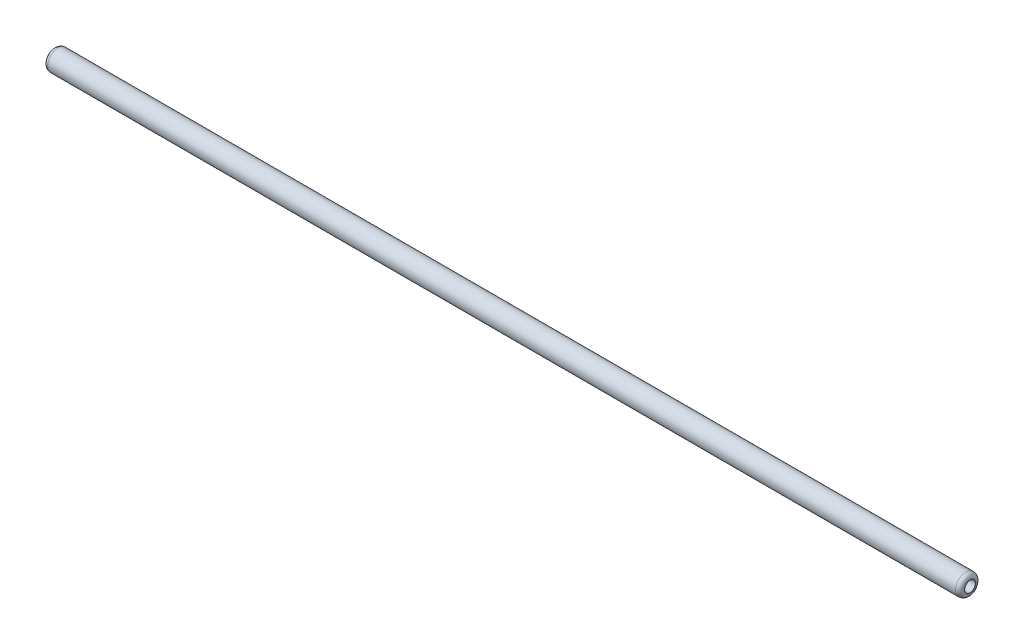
ISO-10303-21;
HEADER;
FILE_DESCRIPTION(('STEP AP214'),'2;1');
FILE_NAME('part.step','',(''),(''),'','','');
FILE_SCHEMA(('AUTOMOTIVE_DESIGN { 1 0 10303 214 1 1 1 1 }'));
ENDSEC;
DATA;
#1=APPLICATION_CONTEXT('core data for automotive mechanical design processes');
#2=APPLICATION_PROTOCOL_DEFINITION('international standard','automotive_design',2000,#1);
#3=PRODUCT_CONTEXT('',#1,'mechanical');
#4=PRODUCT('Part','Part','',(#3));
#5=PRODUCT_RELATED_PRODUCT_CATEGORY('part','',(#4));
#6=PRODUCT_DEFINITION_FORMATION('','',#4);
#7=PRODUCT_DEFINITION_CONTEXT('part definition',#1,'design');
#8=PRODUCT_DEFINITION('design','',#6,#7);
#9=PRODUCT_DEFINITION_SHAPE('','',#8);
#10=(LENGTH_UNIT() NAMED_UNIT(*) SI_UNIT(.MILLI.,.METRE.));
#11=(NAMED_UNIT(*) PLANE_ANGLE_UNIT() SI_UNIT($,.RADIAN.));
#12=(NAMED_UNIT(*) SI_UNIT($,.STERADIAN.) SOLID_ANGLE_UNIT());
#13=UNCERTAINTY_MEASURE_WITH_UNIT(LENGTH_MEASURE(1.E-05),#10,'distance_accuracy_value','');
#14=(GEOMETRIC_REPRESENTATION_CONTEXT(3) GLOBAL_UNCERTAINTY_ASSIGNED_CONTEXT((#13)) GLOBAL_UNIT_ASSIGNED_CONTEXT((#10,
#11,#12)) REPRESENTATION_CONTEXT('',''));
#15=CARTESIAN_POINT('',(0.,0.,0.));
#16=DIRECTION('',(0.,0.,1.));
#17=DIRECTION('',(1.,0.,0.));
#18=AXIS2_PLACEMENT_3D('',#15,#16,#17);
#19=CARTESIAN_POINT('',(558.8,0.,0.));
#20=DIRECTION('',(-1.,0.,0.));
#21=DIRECTION('',(0.,0.,1.));
#22=AXIS2_PLACEMENT_3D('',#19,#20,#21);
#23=CYLINDRICAL_SURFACE('',#22,6.35);
#24=CARTESIAN_POINT('',(556.26,0.,0.));
#25=DIRECTION('',(1.,0.,0.));
#26=DIRECTION('',(0.,0.,-1.));
#27=AXIS2_PLACEMENT_3D('',#24,#25,#26);
#28=CIRCLE('',#27,6.35);
#29=CARTESIAN_POINT('',(556.26,0.,-6.35));
#30=VERTEX_POINT('',#29);
#31=EDGE_CURVE('E45',#30,#30,#28,.F.);
#32=ORIENTED_EDGE('',*,*,#31,.T.);
#33=EDGE_LOOP('',(#32));
#34=FACE_BOUND('',#33,.T.);
#35=CARTESIAN_POINT('',(2.53999999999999,0.,0.));
#36=DIRECTION('',(1.,0.,0.));
#37=DIRECTION('',(0.,0.,-1.));
#38=AXIS2_PLACEMENT_3D('',#35,#36,#37);
#39=CIRCLE('',#38,6.35);
#40=CARTESIAN_POINT('',(2.53999999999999,0.,-6.35));
#41=VERTEX_POINT('',#40);
#42=EDGE_CURVE('E74',#41,#41,#39,.T.);
#43=ORIENTED_EDGE('',*,*,#42,.T.);
#44=EDGE_LOOP('',(#43));
#45=FACE_BOUND('',#44,.T.);
#46=ADVANCED_FACE('F37',(#34,#45),#23,.T.);
#47=CARTESIAN_POINT('',(558.8,0.,0.));
#48=DIRECTION('',(1.,0.,0.));
#49=DIRECTION('',(0.,0.,-1.));
#50=AXIS2_PLACEMENT_3D('',#47,#48,#49);
#51=PLANE('',#50);
#52=CARTESIAN_POINT('',(558.8,0.,0.));
#53=DIRECTION('',(1.,0.,0.));
#54=DIRECTION('',(0.,0.,-1.));
#55=AXIS2_PLACEMENT_3D('',#52,#53,#54);
#56=CIRCLE('',#55,3.26389999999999);
#57=CARTESIAN_POINT('',(558.8,0.,-3.26389999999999));
#58=VERTEX_POINT('',#57);
#59=EDGE_CURVE('E61',#58,#58,#56,.T.);
#60=ORIENTED_EDGE('',*,*,#59,.F.);
#61=EDGE_LOOP('',(#60));
#62=FACE_BOUND('',#61,.T.);
#63=CARTESIAN_POINT('',(558.8,0.,0.));
#64=DIRECTION('',(1.,0.,0.));
#65=DIRECTION('',(0.,0.,-1.));
#66=AXIS2_PLACEMENT_3D('',#63,#64,#65);
#67=CIRCLE('',#66,3.81);
#68=CARTESIAN_POINT('',(558.8,0.,-3.81));
#69=VERTEX_POINT('',#68);
#70=EDGE_CURVE('E71',#69,#69,#67,.T.);
#71=ORIENTED_EDGE('',*,*,#70,.T.);
#72=EDGE_LOOP('',(#71));
#73=FACE_BOUND('',#72,.T.);
#74=ADVANCED_FACE('F87',(#62,#73),#51,.T.);
#75=CARTESIAN_POINT('',(0.,0.,0.));
#76=DIRECTION('',(1.,0.,0.));
#77=DIRECTION('',(0.,0.,-1.));
#78=AXIS2_PLACEMENT_3D('',#75,#76,#77);
#79=PLANE('',#78);
#80=CARTESIAN_POINT('',(0.,0.,0.));
#81=DIRECTION('',(1.,0.,0.));
#82=DIRECTION('',(0.,0.,-1.));
#83=AXIS2_PLACEMENT_3D('',#80,#81,#82);
#84=CIRCLE('',#83,3.81);
#85=CARTESIAN_POINT('',(0.,0.,-3.81));
#86=VERTEX_POINT('',#85);
#87=EDGE_CURVE('E11',#86,#86,#84,.F.);
#88=ORIENTED_EDGE('',*,*,#87,.T.);
#89=EDGE_LOOP('',(#88));
#90=FACE_BOUND('',#89,.T.);
#91=CARTESIAN_POINT('',(0.,0.,0.));
#92=DIRECTION('',(-1.,0.,0.));
#93=DIRECTION('',(0.,0.,1.));
#94=AXIS2_PLACEMENT_3D('',#91,#92,#93);
#95=CIRCLE('',#94,3.26389999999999);
#96=CARTESIAN_POINT('',(0.,0.,3.26389999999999));
#97=VERTEX_POINT('',#96);
#98=EDGE_CURVE('E60',#97,#97,#95,.T.);
#99=ORIENTED_EDGE('',*,*,#98,.F.);
#100=EDGE_LOOP('',(#99));
#101=FACE_BOUND('',#100,.T.);
#102=ADVANCED_FACE('F89',(#90,#101),#79,.F.);
#103=CARTESIAN_POINT('',(31.75,0.,0.));
#104=DIRECTION('',(-1.,0.,0.));
#105=DIRECTION('',(0.,0.,1.));
#106=AXIS2_PLACEMENT_3D('',#103,#104,#105);
#107=CONICAL_SURFACE('',#106,3.26389999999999,1.02974425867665);
#108=CARTESIAN_POINT('',(33.7111489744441,0.,0.));
#109=VERTEX_POINT('',#108);
#110=VERTEX_LOOP('',#109);
#111=FACE_BOUND('',#110,.T.);
#112=CARTESIAN_POINT('',(31.75,0.,0.));
#113=DIRECTION('',(-1.,0.,0.));
#114=DIRECTION('',(0.,0.,1.));
#115=AXIS2_PLACEMENT_3D('',#112,#113,#114);
#116=CIRCLE('',#115,3.26389999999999);
#117=CARTESIAN_POINT('',(31.75,0.,3.26389999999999));
#118=VERTEX_POINT('',#117);
#119=EDGE_CURVE('E64',#118,#118,#116,.T.);
#120=ORIENTED_EDGE('',*,*,#119,.T.);
#121=EDGE_LOOP('',(#120));
#122=FACE_BOUND('',#121,.T.);
#123=ADVANCED_FACE('F96',(#111,#122),#107,.F.);
#124=CARTESIAN_POINT('',(0.,0.,0.));
#125=DIRECTION('',(-1.,0.,0.));
#126=DIRECTION('',(0.,0.,1.));
#127=AXIS2_PLACEMENT_3D('',#124,#125,#126);
#128=CYLINDRICAL_SURFACE('',#127,3.26389999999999);
#129=ORIENTED_EDGE('',*,*,#119,.F.);
#130=EDGE_LOOP('',(#129));
#131=FACE_BOUND('',#130,.T.);
#132=ORIENTED_EDGE('',*,*,#98,.T.);
#133=EDGE_LOOP('',(#132));
#134=FACE_BOUND('',#133,.T.);
#135=ADVANCED_FACE('F84',(#131,#134),#128,.F.);
#136=CARTESIAN_POINT('',(556.26,0.,0.));
#137=DIRECTION('',(1.,0.,0.));
#138=DIRECTION('',(0.,0.,-1.));
#139=AXIS2_PLACEMENT_3D('',#136,#137,#138);
#140=TOROIDAL_SURFACE('',#139,3.81,2.54);
#141=ORIENTED_EDGE('',*,*,#31,.F.);
#142=EDGE_LOOP('',(#141));
#143=FACE_BOUND('',#142,.T.);
#144=ORIENTED_EDGE('',*,*,#70,.F.);
#145=EDGE_LOOP('',(#144));
#146=FACE_BOUND('',#145,.T.);
#147=ADVANCED_FACE('F81',(#143,#146),#140,.T.);
#148=CARTESIAN_POINT('',(2.53999999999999,0.,0.));
#149=DIRECTION('',(1.,0.,0.));
#150=DIRECTION('',(0.,0.,-1.));
#151=AXIS2_PLACEMENT_3D('',#148,#149,#150);
#152=TOROIDAL_SURFACE('',#151,3.81,2.54);
#153=ORIENTED_EDGE('',*,*,#87,.F.);
#154=EDGE_LOOP('',(#153));
#155=FACE_BOUND('',#154,.T.);
#156=ORIENTED_EDGE('',*,*,#42,.F.);
#157=EDGE_LOOP('',(#156));
#158=FACE_BOUND('',#157,.T.);
#159=ADVANCED_FACE('F39',(#155,#158),#152,.T.);
#160=CARTESIAN_POINT('',(527.05,0.,0.));
#161=DIRECTION('',(1.,0.,0.));
#162=DIRECTION('',(0.,0.,-1.));
#163=AXIS2_PLACEMENT_3D('',#160,#161,#162);
#164=CONICAL_SURFACE('',#163,3.26389999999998,1.02974425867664);
#165=CARTESIAN_POINT('',(525.088851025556,0.,0.));
#166=VERTEX_POINT('',#165);
#167=VERTEX_LOOP('',#166);
#168=FACE_BOUND('',#167,.T.);
#169=CARTESIAN_POINT('',(527.05,0.,0.));
#170=DIRECTION('',(1.,0.,0.));
#171=DIRECTION('',(0.,0.,-1.));
#172=AXIS2_PLACEMENT_3D('',#169,#170,#171);
#173=CIRCLE('',#172,3.26389999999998);
#174=CARTESIAN_POINT('',(527.05,0.,-3.26389999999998));
#175=VERTEX_POINT('',#174);
#176=EDGE_CURVE('E58',#175,#175,#173,.T.);
#177=ORIENTED_EDGE('',*,*,#176,.T.);
#178=EDGE_LOOP('',(#177));
#179=FACE_BOUND('',#178,.T.);
#180=ADVANCED_FACE('F51',(#168,#179),#164,.F.);
#181=CARTESIAN_POINT('',(558.8,0.,0.));
#182=DIRECTION('',(1.,0.,0.));
#183=DIRECTION('',(0.,0.,-1.));
#184=AXIS2_PLACEMENT_3D('',#181,#182,#183);
#185=CYLINDRICAL_SURFACE('',#184,3.26389999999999);
#186=ORIENTED_EDGE('',*,*,#176,.F.);
#187=EDGE_LOOP('',(#186));
#188=FACE_BOUND('',#187,.T.);
#189=ORIENTED_EDGE('',*,*,#59,.T.);
#190=EDGE_LOOP('',(#189));
#191=FACE_BOUND('',#190,.T.);
#192=ADVANCED_FACE('F54',(#188,#191),#185,.F.);
#193=CLOSED_SHELL('',(#46,#74,#102,#123,#135,#147,#159,#180,#192));
#194=MANIFOLD_SOLID_BREP('B2',#193);
#195=ADVANCED_BREP_SHAPE_REPRESENTATION('',(#18,#194),#14);
#196=SHAPE_DEFINITION_REPRESENTATION(#9,#195);
ENDSEC;
END-ISO-10303-21;
